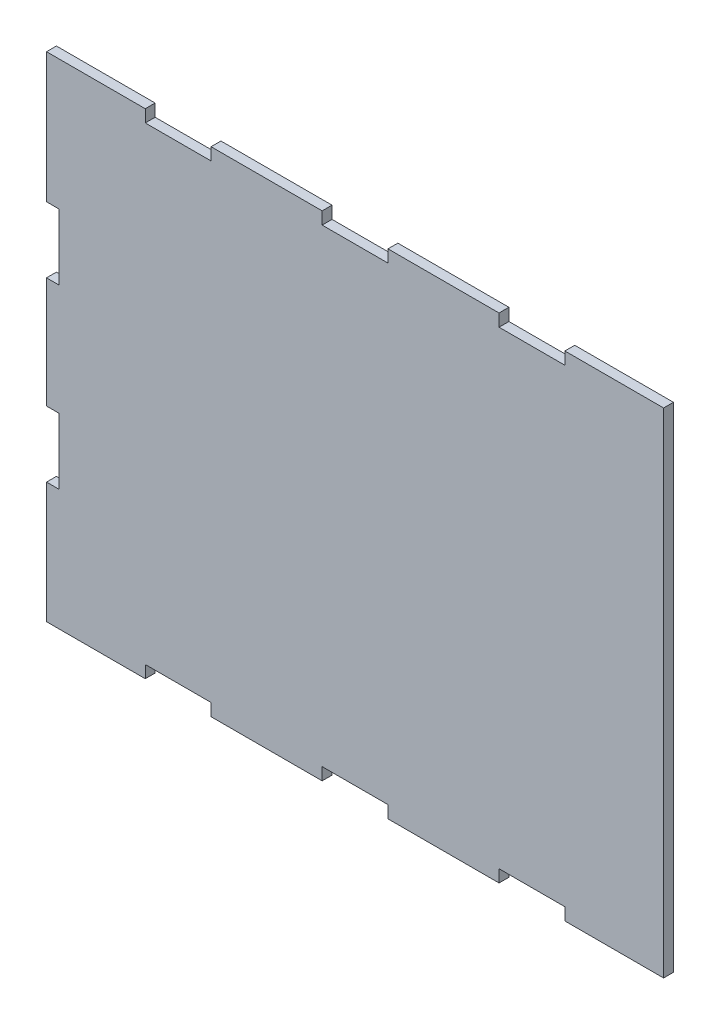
ISO-10303-21;
HEADER;
FILE_DESCRIPTION(('STEP AP214'),'2;1');
FILE_NAME('part.step','',(''),(''),'','','');
FILE_SCHEMA(('AUTOMOTIVE_DESIGN { 1 0 10303 214 1 1 1 1 }'));
ENDSEC;
DATA;
#1=APPLICATION_CONTEXT('core data for automotive mechanical design processes');
#2=APPLICATION_PROTOCOL_DEFINITION('international standard','automotive_design',2000,#1);
#3=PRODUCT_CONTEXT('',#1,'mechanical');
#4=PRODUCT('Part','Part','',(#3));
#5=PRODUCT_RELATED_PRODUCT_CATEGORY('part','',(#4));
#6=PRODUCT_DEFINITION_FORMATION('','',#4);
#7=PRODUCT_DEFINITION_CONTEXT('part definition',#1,'design');
#8=PRODUCT_DEFINITION('design','',#6,#7);
#9=PRODUCT_DEFINITION_SHAPE('','',#8);
#10=(LENGTH_UNIT() NAMED_UNIT(*) SI_UNIT(.MILLI.,.METRE.));
#11=(NAMED_UNIT(*) PLANE_ANGLE_UNIT() SI_UNIT($,.RADIAN.));
#12=(NAMED_UNIT(*) SI_UNIT($,.STERADIAN.) SOLID_ANGLE_UNIT());
#13=UNCERTAINTY_MEASURE_WITH_UNIT(LENGTH_MEASURE(1.E-05),#10,'distance_accuracy_value','');
#14=(GEOMETRIC_REPRESENTATION_CONTEXT(3) GLOBAL_UNCERTAINTY_ASSIGNED_CONTEXT((#13)) GLOBAL_UNIT_ASSIGNED_CONTEXT((#10,
#11,#12)) REPRESENTATION_CONTEXT('',''));
#15=CARTESIAN_POINT('',(0.,0.,0.));
#16=DIRECTION('',(0.,0.,1.));
#17=DIRECTION('',(1.,0.,0.));
#18=AXIS2_PLACEMENT_3D('',#15,#16,#17);
#19=CARTESIAN_POINT('',(-375.,142.,12.));
#20=DIRECTION('',(1.,0.,0.));
#21=DIRECTION('',(0.,0.,-1.));
#22=AXIS2_PLACEMENT_3D('',#19,#20,#21);
#23=PLANE('',#22);
#24=DIRECTION('',(0.,-1.,0.));
#25=VECTOR('',#24,1.);
#26=CARTESIAN_POINT('',(-375.,142.,0.));
#27=LINE('',#26,#25);
#28=CARTESIAN_POINT('',(-375.,300.,0.));
#29=VERTEX_POINT('',#28);
#30=CARTESIAN_POINT('',(-375.,142.,0.));
#31=VERTEX_POINT('',#30);
#32=EDGE_CURVE('E350',#29,#31,#27,.T.);
#33=ORIENTED_EDGE('',*,*,#32,.T.);
#34=DIRECTION('',(0.,0.,-1.));
#35=VECTOR('',#34,1.);
#36=CARTESIAN_POINT('',(-375.,142.,12.));
#37=LINE('',#36,#35);
#38=CARTESIAN_POINT('',(-375.,142.,12.));
#39=VERTEX_POINT('',#38);
#40=EDGE_CURVE('E12',#39,#31,#37,.T.);
#41=ORIENTED_EDGE('',*,*,#40,.F.);
#42=DIRECTION('',(0.,-1.,0.));
#43=VECTOR('',#42,1.);
#44=CARTESIAN_POINT('',(-375.,142.,12.));
#45=LINE('',#44,#43);
#46=CARTESIAN_POINT('',(-375.,300.,12.));
#47=VERTEX_POINT('',#46);
#48=EDGE_CURVE('E416',#47,#39,#45,.T.);
#49=ORIENTED_EDGE('',*,*,#48,.F.);
#50=DIRECTION('',(0.,0.,-1.));
#51=VECTOR('',#50,1.);
#52=CARTESIAN_POINT('',(-375.,300.,12.));
#53=LINE('',#52,#51);
#54=EDGE_CURVE('E343',#47,#29,#53,.T.);
#55=ORIENTED_EDGE('',*,*,#54,.T.);
#56=EDGE_LOOP('',(#33,#41,#49,#55));
#57=FACE_BOUND('',#56,.T.);
#58=ADVANCED_FACE('F82',(#57),#23,.F.);
#59=CARTESIAN_POINT('',(-375.,142.,12.));
#60=DIRECTION('',(0.,1.,0.));
#61=DIRECTION('',(0.,0.,1.));
#62=AXIS2_PLACEMENT_3D('',#59,#60,#61);
#63=PLANE('',#62);
#64=DIRECTION('',(1.,0.,0.));
#65=VECTOR('',#64,1.);
#66=CARTESIAN_POINT('',(-375.,142.,0.));
#67=LINE('',#66,#65);
#68=CARTESIAN_POINT('',(-360.,142.,0.));
#69=VERTEX_POINT('',#68);
#70=EDGE_CURVE('E355',#31,#69,#67,.T.);
#71=ORIENTED_EDGE('',*,*,#70,.T.);
#72=DIRECTION('',(0.,0.,-1.));
#73=VECTOR('',#72,1.);
#74=CARTESIAN_POINT('',(-360.,142.,12.));
#75=LINE('',#74,#73);
#76=CARTESIAN_POINT('',(-360.,142.,12.));
#77=VERTEX_POINT('',#76);
#78=EDGE_CURVE('E93',#77,#69,#75,.T.);
#79=ORIENTED_EDGE('',*,*,#78,.F.);
#80=DIRECTION('',(1.,0.,0.));
#81=VECTOR('',#80,1.);
#82=CARTESIAN_POINT('',(-375.,142.,12.));
#83=LINE('',#82,#81);
#84=EDGE_CURVE('E228',#39,#77,#83,.T.);
#85=ORIENTED_EDGE('',*,*,#84,.F.);
#86=ORIENTED_EDGE('',*,*,#40,.T.);
#87=EDGE_LOOP('',(#71,#79,#85,#86));
#88=FACE_BOUND('',#87,.T.);
#89=ADVANCED_FACE('F617',(#88),#63,.F.);
#90=CARTESIAN_POINT('',(-360.,142.,12.));
#91=DIRECTION('',(1.,0.,0.));
#92=DIRECTION('',(0.,0.,-1.));
#93=AXIS2_PLACEMENT_3D('',#90,#91,#92);
#94=PLANE('',#93);
#95=DIRECTION('',(0.,-1.,0.));
#96=VECTOR('',#95,1.);
#97=CARTESIAN_POINT('',(-360.,142.,0.));
#98=LINE('',#97,#96);
#99=CARTESIAN_POINT('',(-360.,62.0000000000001,0.));
#100=VERTEX_POINT('',#99);
#101=EDGE_CURVE('E354',#69,#100,#98,.T.);
#102=ORIENTED_EDGE('',*,*,#101,.T.);
#103=DIRECTION('',(0.,0.,-1.));
#104=VECTOR('',#103,1.);
#105=CARTESIAN_POINT('',(-360.,62.0000000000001,12.));
#106=LINE('',#105,#104);
#107=CARTESIAN_POINT('',(-360.,62.0000000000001,12.));
#108=VERTEX_POINT('',#107);
#109=EDGE_CURVE('E508',#108,#100,#106,.T.);
#110=ORIENTED_EDGE('',*,*,#109,.F.);
#111=DIRECTION('',(0.,-1.,0.));
#112=VECTOR('',#111,1.);
#113=CARTESIAN_POINT('',(-360.,142.,12.));
#114=LINE('',#113,#112);
#115=EDGE_CURVE('E516',#77,#108,#114,.T.);
#116=ORIENTED_EDGE('',*,*,#115,.F.);
#117=ORIENTED_EDGE('',*,*,#78,.T.);
#118=EDGE_LOOP('',(#102,#110,#116,#117));
#119=FACE_BOUND('',#118,.T.);
#120=ADVANCED_FACE('F517',(#119),#94,.F.);
#121=CARTESIAN_POINT('',(-375.,62.0000000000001,12.));
#122=DIRECTION('',(0.,-1.,0.));
#123=DIRECTION('',(1.,0.,0.));
#124=AXIS2_PLACEMENT_3D('',#121,#122,#123);
#125=PLANE('',#124);
#126=DIRECTION('',(-1.,0.,0.));
#127=VECTOR('',#126,1.);
#128=CARTESIAN_POINT('',(-375.,62.0000000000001,0.));
#129=LINE('',#128,#127);
#130=CARTESIAN_POINT('',(-375.,62.0000000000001,0.));
#131=VERTEX_POINT('',#130);
#132=EDGE_CURVE('E356',#100,#131,#129,.T.);
#133=ORIENTED_EDGE('',*,*,#132,.T.);
#134=DIRECTION('',(0.,0.,-1.));
#135=VECTOR('',#134,1.);
#136=CARTESIAN_POINT('',(-375.,62.0000000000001,12.));
#137=LINE('',#136,#135);
#138=CARTESIAN_POINT('',(-375.,62.0000000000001,12.));
#139=VERTEX_POINT('',#138);
#140=EDGE_CURVE('E510',#139,#131,#137,.T.);
#141=ORIENTED_EDGE('',*,*,#140,.F.);
#142=DIRECTION('',(-1.,0.,0.));
#143=VECTOR('',#142,1.);
#144=CARTESIAN_POINT('',(-375.,62.0000000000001,12.));
#145=LINE('',#144,#143);
#146=EDGE_CURVE('E536',#108,#139,#145,.T.);
#147=ORIENTED_EDGE('',*,*,#146,.F.);
#148=ORIENTED_EDGE('',*,*,#109,.T.);
#149=EDGE_LOOP('',(#133,#141,#147,#148));
#150=FACE_BOUND('',#149,.T.);
#151=ADVANCED_FACE('F527',(#150),#125,.F.);
#152=CARTESIAN_POINT('',(-375.,-72.9999999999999,12.));
#153=DIRECTION('',(1.,0.,0.));
#154=DIRECTION('',(0.,0.,-1.));
#155=AXIS2_PLACEMENT_3D('',#152,#153,#154);
#156=PLANE('',#155);
#157=DIRECTION('',(0.,-1.,0.));
#158=VECTOR('',#157,1.);
#159=CARTESIAN_POINT('',(-375.,-72.9999999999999,0.));
#160=LINE('',#159,#158);
#161=CARTESIAN_POINT('',(-375.,-72.9999999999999,0.));
#162=VERTEX_POINT('',#161);
#163=EDGE_CURVE('E358',#131,#162,#160,.T.);
#164=ORIENTED_EDGE('',*,*,#163,.T.);
#165=DIRECTION('',(0.,0.,-1.));
#166=VECTOR('',#165,1.);
#167=CARTESIAN_POINT('',(-375.,-72.9999999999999,12.));
#168=LINE('',#167,#166);
#169=CARTESIAN_POINT('',(-375.,-72.9999999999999,12.));
#170=VERTEX_POINT('',#169);
#171=EDGE_CURVE('E503',#170,#162,#168,.T.);
#172=ORIENTED_EDGE('',*,*,#171,.F.);
#173=DIRECTION('',(0.,-1.,0.));
#174=VECTOR('',#173,1.);
#175=CARTESIAN_POINT('',(-375.,-72.9999999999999,12.));
#176=LINE('',#175,#174);
#177=EDGE_CURVE('E531',#139,#170,#176,.T.);
#178=ORIENTED_EDGE('',*,*,#177,.F.);
#179=ORIENTED_EDGE('',*,*,#140,.T.);
#180=EDGE_LOOP('',(#164,#172,#178,#179));
#181=FACE_BOUND('',#180,.T.);
#182=ADVANCED_FACE('F533',(#181),#156,.F.);
#183=CARTESIAN_POINT('',(-375.,-72.9999999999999,12.));
#184=DIRECTION('',(0.,1.,0.));
#185=DIRECTION('',(-1.,0.,0.));
#186=AXIS2_PLACEMENT_3D('',#183,#184,#185);
#187=PLANE('',#186);
#188=DIRECTION('',(1.,0.,0.));
#189=VECTOR('',#188,1.);
#190=CARTESIAN_POINT('',(-375.,-72.9999999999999,0.));
#191=LINE('',#190,#189);
#192=CARTESIAN_POINT('',(-360.,-72.9999999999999,0.));
#193=VERTEX_POINT('',#192);
#194=EDGE_CURVE('E359',#162,#193,#191,.T.);
#195=ORIENTED_EDGE('',*,*,#194,.T.);
#196=DIRECTION('',(0.,0.,-1.));
#197=VECTOR('',#196,1.);
#198=CARTESIAN_POINT('',(-360.,-72.9999999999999,12.));
#199=LINE('',#198,#197);
#200=CARTESIAN_POINT('',(-360.,-72.9999999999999,12.));
#201=VERTEX_POINT('',#200);
#202=EDGE_CURVE('E501',#201,#193,#199,.T.);
#203=ORIENTED_EDGE('',*,*,#202,.F.);
#204=DIRECTION('',(1.,0.,0.));
#205=VECTOR('',#204,1.);
#206=CARTESIAN_POINT('',(-375.,-72.9999999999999,12.));
#207=LINE('',#206,#205);
#208=EDGE_CURVE('E532',#170,#201,#207,.T.);
#209=ORIENTED_EDGE('',*,*,#208,.F.);
#210=ORIENTED_EDGE('',*,*,#171,.T.);
#211=EDGE_LOOP('',(#195,#203,#209,#210));
#212=FACE_BOUND('',#211,.T.);
#213=ADVANCED_FACE('F629',(#212),#187,.F.);
#214=CARTESIAN_POINT('',(-360.,-72.9999999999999,12.));
#215=DIRECTION('',(1.,0.,0.));
#216=DIRECTION('',(0.,1.,0.));
#217=AXIS2_PLACEMENT_3D('',#214,#215,#216);
#218=PLANE('',#217);
#219=DIRECTION('',(0.,-1.,0.));
#220=VECTOR('',#219,1.);
#221=CARTESIAN_POINT('',(-360.,-72.9999999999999,0.));
#222=LINE('',#221,#220);
#223=CARTESIAN_POINT('',(-360.,-153.,0.));
#224=VERTEX_POINT('',#223);
#225=EDGE_CURVE('E365',#193,#224,#222,.T.);
#226=ORIENTED_EDGE('',*,*,#225,.T.);
#227=DIRECTION('',(0.,0.,-1.));
#228=VECTOR('',#227,1.);
#229=CARTESIAN_POINT('',(-360.,-153.,12.));
#230=LINE('',#229,#228);
#231=CARTESIAN_POINT('',(-360.,-153.,12.));
#232=VERTEX_POINT('',#231);
#233=EDGE_CURVE('E498',#232,#224,#230,.T.);
#234=ORIENTED_EDGE('',*,*,#233,.F.);
#235=DIRECTION('',(0.,-1.,0.));
#236=VECTOR('',#235,1.);
#237=CARTESIAN_POINT('',(-360.,-72.9999999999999,12.));
#238=LINE('',#237,#236);
#239=EDGE_CURVE('E538',#201,#232,#238,.T.);
#240=ORIENTED_EDGE('',*,*,#239,.F.);
#241=ORIENTED_EDGE('',*,*,#202,.T.);
#242=EDGE_LOOP('',(#226,#234,#240,#241));
#243=FACE_BOUND('',#242,.T.);
#244=ADVANCED_FACE('F633',(#243),#218,.F.);
#245=CARTESIAN_POINT('',(-375.,-153.,12.));
#246=DIRECTION('',(0.,-1.,0.));
#247=DIRECTION('',(0.,0.,-1.));
#248=AXIS2_PLACEMENT_3D('',#245,#246,#247);
#249=PLANE('',#248);
#250=DIRECTION('',(-1.,0.,0.));
#251=VECTOR('',#250,1.);
#252=CARTESIAN_POINT('',(-375.,-153.,0.));
#253=LINE('',#252,#251);
#254=CARTESIAN_POINT('',(-375.,-153.,0.));
#255=VERTEX_POINT('',#254);
#256=EDGE_CURVE('E362',#224,#255,#253,.T.);
#257=ORIENTED_EDGE('',*,*,#256,.T.);
#258=DIRECTION('',(0.,0.,-1.));
#259=VECTOR('',#258,1.);
#260=CARTESIAN_POINT('',(-375.,-153.,12.));
#261=LINE('',#260,#259);
#262=CARTESIAN_POINT('',(-375.,-153.,12.));
#263=VERTEX_POINT('',#262);
#264=EDGE_CURVE('E494',#263,#255,#261,.T.);
#265=ORIENTED_EDGE('',*,*,#264,.F.);
#266=DIRECTION('',(-1.,0.,0.));
#267=VECTOR('',#266,1.);
#268=CARTESIAN_POINT('',(-375.,-153.,12.));
#269=LINE('',#268,#267);
#270=EDGE_CURVE('E542',#232,#263,#269,.T.);
#271=ORIENTED_EDGE('',*,*,#270,.F.);
#272=ORIENTED_EDGE('',*,*,#233,.T.);
#273=EDGE_LOOP('',(#257,#265,#271,#272));
#274=FACE_BOUND('',#273,.T.);
#275=ADVANCED_FACE('F640',(#274),#249,.F.);
#276=CARTESIAN_POINT('',(-375.,-300.,12.));
#277=DIRECTION('',(1.,0.,0.));
#278=DIRECTION('',(0.,0.,-1.));
#279=AXIS2_PLACEMENT_3D('',#276,#277,#278);
#280=PLANE('',#279);
#281=DIRECTION('',(0.,-1.,0.));
#282=VECTOR('',#281,1.);
#283=CARTESIAN_POINT('',(-375.,-300.,0.));
#284=LINE('',#283,#282);
#285=CARTESIAN_POINT('',(-375.,-300.,0.));
#286=VERTEX_POINT('',#285);
#287=EDGE_CURVE('E366',#255,#286,#284,.T.);
#288=ORIENTED_EDGE('',*,*,#287,.T.);
#289=DIRECTION('',(0.,0.,-1.));
#290=VECTOR('',#289,1.);
#291=CARTESIAN_POINT('',(-375.,-300.,12.));
#292=LINE('',#291,#290);
#293=CARTESIAN_POINT('',(-375.,-300.,12.));
#294=VERTEX_POINT('',#293);
#295=EDGE_CURVE('E495',#294,#286,#292,.T.);
#296=ORIENTED_EDGE('',*,*,#295,.F.);
#297=DIRECTION('',(0.,-1.,0.));
#298=VECTOR('',#297,1.);
#299=CARTESIAN_POINT('',(-375.,-300.,12.));
#300=LINE('',#299,#298);
#301=EDGE_CURVE('E546',#263,#294,#300,.T.);
#302=ORIENTED_EDGE('',*,*,#301,.F.);
#303=ORIENTED_EDGE('',*,*,#264,.T.);
#304=EDGE_LOOP('',(#288,#296,#302,#303));
#305=FACE_BOUND('',#304,.T.);
#306=ADVANCED_FACE('F642',(#305),#280,.F.);
#307=CARTESIAN_POINT('',(-255.,-300.,12.));
#308=DIRECTION('',(0.,1.,0.));
#309=DIRECTION('',(-1.,0.,0.));
#310=AXIS2_PLACEMENT_3D('',#307,#308,#309);
#311=PLANE('',#310);
#312=DIRECTION('',(1.,0.,0.));
#313=VECTOR('',#312,1.);
#314=CARTESIAN_POINT('',(-255.,-300.,0.));
#315=LINE('',#314,#313);
#316=CARTESIAN_POINT('',(-255.,-300.,0.));
#317=VERTEX_POINT('',#316);
#318=EDGE_CURVE('E367',#286,#317,#315,.T.);
#319=ORIENTED_EDGE('',*,*,#318,.T.);
#320=DIRECTION('',(0.,0.,-1.));
#321=VECTOR('',#320,1.);
#322=CARTESIAN_POINT('',(-255.,-300.,12.));
#323=LINE('',#322,#321);
#324=CARTESIAN_POINT('',(-255.,-300.,12.));
#325=VERTEX_POINT('',#324);
#326=EDGE_CURVE('E489',#325,#317,#323,.T.);
#327=ORIENTED_EDGE('',*,*,#326,.F.);
#328=DIRECTION('',(1.,0.,0.));
#329=VECTOR('',#328,1.);
#330=CARTESIAN_POINT('',(-255.,-300.,12.));
#331=LINE('',#330,#329);
#332=EDGE_CURVE('E547',#294,#325,#331,.T.);
#333=ORIENTED_EDGE('',*,*,#332,.F.);
#334=ORIENTED_EDGE('',*,*,#295,.T.);
#335=EDGE_LOOP('',(#319,#327,#333,#334));
#336=FACE_BOUND('',#335,.T.);
#337=ADVANCED_FACE('F643',(#336),#311,.F.);
#338=CARTESIAN_POINT('',(-255.,-300.,12.));
#339=DIRECTION('',(-1.,0.,0.));
#340=DIRECTION('',(0.,0.,1.));
#341=AXIS2_PLACEMENT_3D('',#338,#339,#340);
#342=PLANE('',#341);
#343=DIRECTION('',(0.,1.,0.));
#344=VECTOR('',#343,1.);
#345=CARTESIAN_POINT('',(-255.,-300.,0.));
#346=LINE('',#345,#344);
#347=CARTESIAN_POINT('',(-255.,-285.,0.));
#348=VERTEX_POINT('',#347);
#349=EDGE_CURVE('E369',#317,#348,#346,.T.);
#350=ORIENTED_EDGE('',*,*,#349,.T.);
#351=DIRECTION('',(0.,0.,-1.));
#352=VECTOR('',#351,1.);
#353=CARTESIAN_POINT('',(-255.,-285.,12.));
#354=LINE('',#353,#352);
#355=CARTESIAN_POINT('',(-255.,-285.,12.));
#356=VERTEX_POINT('',#355);
#357=EDGE_CURVE('E488',#356,#348,#354,.T.);
#358=ORIENTED_EDGE('',*,*,#357,.F.);
#359=DIRECTION('',(0.,1.,0.));
#360=VECTOR('',#359,1.);
#361=CARTESIAN_POINT('',(-255.,-300.,12.));
#362=LINE('',#361,#360);
#363=EDGE_CURVE('E549',#325,#356,#362,.T.);
#364=ORIENTED_EDGE('',*,*,#363,.F.);
#365=ORIENTED_EDGE('',*,*,#326,.T.);
#366=EDGE_LOOP('',(#350,#358,#364,#365));
#367=FACE_BOUND('',#366,.T.);
#368=ADVANCED_FACE('F646',(#367),#342,.F.);
#369=CARTESIAN_POINT('',(-255.,-285.,12.));
#370=DIRECTION('',(0.,1.,0.));
#371=DIRECTION('',(0.,0.,1.));
#372=AXIS2_PLACEMENT_3D('',#369,#370,#371);
#373=PLANE('',#372);
#374=DIRECTION('',(1.,0.,0.));
#375=VECTOR('',#374,1.);
#376=CARTESIAN_POINT('',(-255.,-285.,0.));
#377=LINE('',#376,#375);
#378=CARTESIAN_POINT('',(-175.,-285.,0.));
#379=VERTEX_POINT('',#378);
#380=EDGE_CURVE('E375',#348,#379,#377,.T.);
#381=ORIENTED_EDGE('',*,*,#380,.T.);
#382=DIRECTION('',(0.,0.,-1.));
#383=VECTOR('',#382,1.);
#384=CARTESIAN_POINT('',(-175.,-285.,12.));
#385=LINE('',#384,#383);
#386=CARTESIAN_POINT('',(-175.,-285.,12.));
#387=VERTEX_POINT('',#386);
#388=EDGE_CURVE('E481',#387,#379,#385,.T.);
#389=ORIENTED_EDGE('',*,*,#388,.F.);
#390=DIRECTION('',(1.,0.,0.));
#391=VECTOR('',#390,1.);
#392=CARTESIAN_POINT('',(-255.,-285.,12.));
#393=LINE('',#392,#391);
#394=EDGE_CURVE('E555',#356,#387,#393,.T.);
#395=ORIENTED_EDGE('',*,*,#394,.F.);
#396=ORIENTED_EDGE('',*,*,#357,.T.);
#397=EDGE_LOOP('',(#381,#389,#395,#396));
#398=FACE_BOUND('',#397,.T.);
#399=ADVANCED_FACE('F651',(#398),#373,.F.);
#400=CARTESIAN_POINT('',(-175.,-300.,12.));
#401=DIRECTION('',(1.,0.,0.));
#402=DIRECTION('',(0.,0.,-1.));
#403=AXIS2_PLACEMENT_3D('',#400,#401,#402);
#404=PLANE('',#403);
#405=DIRECTION('',(0.,-1.,0.));
#406=VECTOR('',#405,1.);
#407=CARTESIAN_POINT('',(-175.,-300.,0.));
#408=LINE('',#407,#406);
#409=CARTESIAN_POINT('',(-175.,-300.,0.));
#410=VERTEX_POINT('',#409);
#411=EDGE_CURVE('E371',#379,#410,#408,.T.);
#412=ORIENTED_EDGE('',*,*,#411,.T.);
#413=DIRECTION('',(0.,0.,-1.));
#414=VECTOR('',#413,1.);
#415=CARTESIAN_POINT('',(-175.,-300.,12.));
#416=LINE('',#415,#414);
#417=CARTESIAN_POINT('',(-175.,-300.,12.));
#418=VERTEX_POINT('',#417);
#419=EDGE_CURVE('E478',#418,#410,#416,.T.);
#420=ORIENTED_EDGE('',*,*,#419,.F.);
#421=DIRECTION('',(0.,-1.,0.));
#422=VECTOR('',#421,1.);
#423=CARTESIAN_POINT('',(-175.,-300.,12.));
#424=LINE('',#423,#422);
#425=EDGE_CURVE('E551',#387,#418,#424,.T.);
#426=ORIENTED_EDGE('',*,*,#425,.F.);
#427=ORIENTED_EDGE('',*,*,#388,.T.);
#428=EDGE_LOOP('',(#412,#420,#426,#427));
#429=FACE_BOUND('',#428,.T.);
#430=ADVANCED_FACE('F659',(#429),#404,.F.);
#431=CARTESIAN_POINT('',(-39.9999999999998,-300.,12.));
#432=DIRECTION('',(0.,1.,0.));
#433=DIRECTION('',(-1.,0.,0.));
#434=AXIS2_PLACEMENT_3D('',#431,#432,#433);
#435=PLANE('',#434);
#436=DIRECTION('',(1.,0.,0.));
#437=VECTOR('',#436,1.);
#438=CARTESIAN_POINT('',(-39.9999999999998,-300.,0.));
#439=LINE('',#438,#437);
#440=CARTESIAN_POINT('',(-39.9999999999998,-300.,0.));
#441=VERTEX_POINT('',#440);
#442=EDGE_CURVE('E377',#410,#441,#439,.T.);
#443=ORIENTED_EDGE('',*,*,#442,.T.);
#444=DIRECTION('',(0.,0.,-1.));
#445=VECTOR('',#444,1.);
#446=CARTESIAN_POINT('',(-39.9999999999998,-300.,12.));
#447=LINE('',#446,#445);
#448=CARTESIAN_POINT('',(-39.9999999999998,-300.,12.));
#449=VERTEX_POINT('',#448);
#450=EDGE_CURVE('E479',#449,#441,#447,.T.);
#451=ORIENTED_EDGE('',*,*,#450,.F.);
#452=DIRECTION('',(1.,0.,0.));
#453=VECTOR('',#452,1.);
#454=CARTESIAN_POINT('',(-39.9999999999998,-300.,12.));
#455=LINE('',#454,#453);
#456=EDGE_CURVE('E557',#418,#449,#455,.T.);
#457=ORIENTED_EDGE('',*,*,#456,.F.);
#458=ORIENTED_EDGE('',*,*,#419,.T.);
#459=EDGE_LOOP('',(#443,#451,#457,#458));
#460=FACE_BOUND('',#459,.T.);
#461=ADVANCED_FACE('F663',(#460),#435,.F.);
#462=CARTESIAN_POINT('',(-39.9999999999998,-300.,12.));
#463=DIRECTION('',(-1.,0.,0.));
#464=DIRECTION('',(0.,0.,1.));
#465=AXIS2_PLACEMENT_3D('',#462,#463,#464);
#466=PLANE('',#465);
#467=DIRECTION('',(0.,1.,0.));
#468=VECTOR('',#467,1.);
#469=CARTESIAN_POINT('',(-39.9999999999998,-300.,0.));
#470=LINE('',#469,#468);
#471=CARTESIAN_POINT('',(-39.9999999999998,-285.,0.));
#472=VERTEX_POINT('',#471);
#473=EDGE_CURVE('E380',#441,#472,#470,.T.);
#474=ORIENTED_EDGE('',*,*,#473,.T.);
#475=DIRECTION('',(0.,0.,-1.));
#476=VECTOR('',#475,1.);
#477=CARTESIAN_POINT('',(-39.9999999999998,-285.,12.));
#478=LINE('',#477,#476);
#479=CARTESIAN_POINT('',(-39.9999999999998,-285.,12.));
#480=VERTEX_POINT('',#479);
#481=EDGE_CURVE('E474',#480,#472,#478,.T.);
#482=ORIENTED_EDGE('',*,*,#481,.F.);
#483=DIRECTION('',(0.,1.,0.));
#484=VECTOR('',#483,1.);
#485=CARTESIAN_POINT('',(-39.9999999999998,-300.,12.));
#486=LINE('',#485,#484);
#487=EDGE_CURVE('E560',#449,#480,#486,.T.);
#488=ORIENTED_EDGE('',*,*,#487,.F.);
#489=ORIENTED_EDGE('',*,*,#450,.T.);
#490=EDGE_LOOP('',(#474,#482,#488,#489));
#491=FACE_BOUND('',#490,.T.);
#492=ADVANCED_FACE('F664',(#491),#466,.F.);
#493=CARTESIAN_POINT('',(-39.9999999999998,-285.,12.));
#494=DIRECTION('',(0.,1.,0.));
#495=DIRECTION('',(0.,0.,1.));
#496=AXIS2_PLACEMENT_3D('',#493,#494,#495);
#497=PLANE('',#496);
#498=DIRECTION('',(1.,0.,0.));
#499=VECTOR('',#498,1.);
#500=CARTESIAN_POINT('',(-39.9999999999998,-285.,0.));
#501=LINE('',#500,#499);
#502=CARTESIAN_POINT('',(40.0000000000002,-285.,0.));
#503=VERTEX_POINT('',#502);
#504=EDGE_CURVE('E378',#472,#503,#501,.T.);
#505=ORIENTED_EDGE('',*,*,#504,.T.);
#506=DIRECTION('',(0.,0.,-1.));
#507=VECTOR('',#506,1.);
#508=CARTESIAN_POINT('',(40.0000000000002,-285.,12.));
#509=LINE('',#508,#507);
#510=CARTESIAN_POINT('',(40.0000000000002,-285.,12.));
#511=VERTEX_POINT('',#510);
#512=EDGE_CURVE('E472',#511,#503,#509,.T.);
#513=ORIENTED_EDGE('',*,*,#512,.F.);
#514=DIRECTION('',(1.,0.,0.));
#515=VECTOR('',#514,1.);
#516=CARTESIAN_POINT('',(-39.9999999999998,-285.,12.));
#517=LINE('',#516,#515);
#518=EDGE_CURVE('E558',#480,#511,#517,.T.);
#519=ORIENTED_EDGE('',*,*,#518,.F.);
#520=ORIENTED_EDGE('',*,*,#481,.T.);
#521=EDGE_LOOP('',(#505,#513,#519,#520));
#522=FACE_BOUND('',#521,.T.);
#523=ADVANCED_FACE('F669',(#522),#497,.F.);
#524=CARTESIAN_POINT('',(40.0000000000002,-300.,12.));
#525=DIRECTION('',(1.,0.,0.));
#526=DIRECTION('',(0.,0.,-1.));
#527=AXIS2_PLACEMENT_3D('',#524,#525,#526);
#528=PLANE('',#527);
#529=DIRECTION('',(0.,-1.,0.));
#530=VECTOR('',#529,1.);
#531=CARTESIAN_POINT('',(40.0000000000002,-300.,0.));
#532=LINE('',#531,#530);
#533=CARTESIAN_POINT('',(40.0000000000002,-300.,0.));
#534=VERTEX_POINT('',#533);
#535=EDGE_CURVE('E385',#503,#534,#532,.T.);
#536=ORIENTED_EDGE('',*,*,#535,.T.);
#537=DIRECTION('',(0.,0.,-1.));
#538=VECTOR('',#537,1.);
#539=CARTESIAN_POINT('',(40.0000000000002,-300.,12.));
#540=LINE('',#539,#538);
#541=CARTESIAN_POINT('',(40.0000000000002,-300.,12.));
#542=VERTEX_POINT('',#541);
#543=EDGE_CURVE('E470',#542,#534,#540,.T.);
#544=ORIENTED_EDGE('',*,*,#543,.F.);
#545=DIRECTION('',(0.,-1.,0.));
#546=VECTOR('',#545,1.);
#547=CARTESIAN_POINT('',(40.0000000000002,-300.,12.));
#548=LINE('',#547,#546);
#549=EDGE_CURVE('E565',#511,#542,#548,.T.);
#550=ORIENTED_EDGE('',*,*,#549,.F.);
#551=ORIENTED_EDGE('',*,*,#512,.T.);
#552=EDGE_LOOP('',(#536,#544,#550,#551));
#553=FACE_BOUND('',#552,.T.);
#554=ADVANCED_FACE('F673',(#553),#528,.F.);
#555=CARTESIAN_POINT('',(175.,-300.,12.));
#556=DIRECTION('',(0.,1.,0.));
#557=DIRECTION('',(-1.,0.,0.));
#558=AXIS2_PLACEMENT_3D('',#555,#556,#557);
#559=PLANE('',#558);
#560=DIRECTION('',(1.,0.,0.));
#561=VECTOR('',#560,1.);
#562=CARTESIAN_POINT('',(175.,-300.,0.));
#563=LINE('',#562,#561);
#564=CARTESIAN_POINT('',(175.,-300.,0.));
#565=VERTEX_POINT('',#564);
#566=EDGE_CURVE('E384',#534,#565,#563,.T.);
#567=ORIENTED_EDGE('',*,*,#566,.T.);
#568=DIRECTION('',(0.,0.,-1.));
#569=VECTOR('',#568,1.);
#570=CARTESIAN_POINT('',(175.,-300.,12.));
#571=LINE('',#570,#569);
#572=CARTESIAN_POINT('',(175.,-300.,12.));
#573=VERTEX_POINT('',#572);
#574=EDGE_CURVE('E463',#573,#565,#571,.T.);
#575=ORIENTED_EDGE('',*,*,#574,.F.);
#576=DIRECTION('',(1.,0.,0.));
#577=VECTOR('',#576,1.);
#578=CARTESIAN_POINT('',(175.,-300.,12.));
#579=LINE('',#578,#577);
#580=EDGE_CURVE('E564',#542,#573,#579,.T.);
#581=ORIENTED_EDGE('',*,*,#580,.F.);
#582=ORIENTED_EDGE('',*,*,#543,.T.);
#583=EDGE_LOOP('',(#567,#575,#581,#582));
#584=FACE_BOUND('',#583,.T.);
#585=ADVANCED_FACE('F680',(#584),#559,.F.);
#586=CARTESIAN_POINT('',(175.,-300.,12.));
#587=DIRECTION('',(-1.,0.,0.));
#588=DIRECTION('',(0.,0.,1.));
#589=AXIS2_PLACEMENT_3D('',#586,#587,#588);
#590=PLANE('',#589);
#591=DIRECTION('',(0.,1.,0.));
#592=VECTOR('',#591,1.);
#593=CARTESIAN_POINT('',(175.,-300.,0.));
#594=LINE('',#593,#592);
#595=CARTESIAN_POINT('',(175.,-285.,0.));
#596=VERTEX_POINT('',#595);
#597=EDGE_CURVE('E387',#565,#596,#594,.T.);
#598=ORIENTED_EDGE('',*,*,#597,.T.);
#599=DIRECTION('',(0.,0.,-1.));
#600=VECTOR('',#599,1.);
#601=CARTESIAN_POINT('',(175.,-285.,12.));
#602=LINE('',#601,#600);
#603=CARTESIAN_POINT('',(175.,-285.,12.));
#604=VERTEX_POINT('',#603);
#605=EDGE_CURVE('E465',#604,#596,#602,.T.);
#606=ORIENTED_EDGE('',*,*,#605,.F.);
#607=DIRECTION('',(0.,1.,0.));
#608=VECTOR('',#607,1.);
#609=CARTESIAN_POINT('',(175.,-300.,12.));
#610=LINE('',#609,#608);
#611=EDGE_CURVE('E567',#573,#604,#610,.T.);
#612=ORIENTED_EDGE('',*,*,#611,.F.);
#613=ORIENTED_EDGE('',*,*,#574,.T.);
#614=EDGE_LOOP('',(#598,#606,#612,#613));
#615=FACE_BOUND('',#614,.T.);
#616=ADVANCED_FACE('F681',(#615),#590,.F.);
#617=CARTESIAN_POINT('',(175.,-285.,12.));
#618=DIRECTION('',(0.,1.,0.));
#619=DIRECTION('',(0.,0.,1.));
#620=AXIS2_PLACEMENT_3D('',#617,#618,#619);
#621=PLANE('',#620);
#622=DIRECTION('',(1.,0.,0.));
#623=VECTOR('',#622,1.);
#624=CARTESIAN_POINT('',(175.,-285.,0.));
#625=LINE('',#624,#623);
#626=CARTESIAN_POINT('',(255.,-285.,0.));
#627=VERTEX_POINT('',#626);
#628=EDGE_CURVE('E390',#596,#627,#625,.T.);
#629=ORIENTED_EDGE('',*,*,#628,.T.);
#630=DIRECTION('',(0.,0.,-1.));
#631=VECTOR('',#630,1.);
#632=CARTESIAN_POINT('',(255.,-285.,12.));
#633=LINE('',#632,#631);
#634=CARTESIAN_POINT('',(255.,-285.,12.));
#635=VERTEX_POINT('',#634);
#636=EDGE_CURVE('E458',#635,#627,#633,.T.);
#637=ORIENTED_EDGE('',*,*,#636,.F.);
#638=DIRECTION('',(1.,0.,0.));
#639=VECTOR('',#638,1.);
#640=CARTESIAN_POINT('',(175.,-285.,12.));
#641=LINE('',#640,#639);
#642=EDGE_CURVE('E570',#604,#635,#641,.T.);
#643=ORIENTED_EDGE('',*,*,#642,.F.);
#644=ORIENTED_EDGE('',*,*,#605,.T.);
#645=EDGE_LOOP('',(#629,#637,#643,#644));
#646=FACE_BOUND('',#645,.T.);
#647=ADVANCED_FACE('F684',(#646),#621,.F.);
#648=CARTESIAN_POINT('',(255.,-300.,12.));
#649=DIRECTION('',(1.,0.,0.));
#650=DIRECTION('',(0.,0.,-1.));
#651=AXIS2_PLACEMENT_3D('',#648,#649,#650);
#652=PLANE('',#651);
#653=DIRECTION('',(0.,-1.,0.));
#654=VECTOR('',#653,1.);
#655=CARTESIAN_POINT('',(255.,-300.,0.));
#656=LINE('',#655,#654);
#657=CARTESIAN_POINT('',(255.,-300.,0.));
#658=VERTEX_POINT('',#657);
#659=EDGE_CURVE('E388',#627,#658,#656,.T.);
#660=ORIENTED_EDGE('',*,*,#659,.T.);
#661=DIRECTION('',(0.,0.,-1.));
#662=VECTOR('',#661,1.);
#663=CARTESIAN_POINT('',(255.,-300.,12.));
#664=LINE('',#663,#662);
#665=CARTESIAN_POINT('',(255.,-300.,12.));
#666=VERTEX_POINT('',#665);
#667=EDGE_CURVE('E456',#666,#658,#664,.T.);
#668=ORIENTED_EDGE('',*,*,#667,.F.);
#669=DIRECTION('',(0.,-1.,0.));
#670=VECTOR('',#669,1.);
#671=CARTESIAN_POINT('',(255.,-300.,12.));
#672=LINE('',#671,#670);
#673=EDGE_CURVE('E568',#635,#666,#672,.T.);
#674=ORIENTED_EDGE('',*,*,#673,.F.);
#675=ORIENTED_EDGE('',*,*,#636,.T.);
#676=EDGE_LOOP('',(#660,#668,#674,#675));
#677=FACE_BOUND('',#676,.T.);
#678=ADVANCED_FACE('F686',(#677),#652,.F.);
#679=CARTESIAN_POINT('',(375.,-300.,12.));
#680=DIRECTION('',(0.,1.,0.));
#681=DIRECTION('',(-1.,0.,0.));
#682=AXIS2_PLACEMENT_3D('',#679,#680,#681);
#683=PLANE('',#682);
#684=DIRECTION('',(1.,0.,0.));
#685=VECTOR('',#684,1.);
#686=CARTESIAN_POINT('',(375.,-300.,0.));
#687=LINE('',#686,#685);
#688=CARTESIAN_POINT('',(375.,-300.,0.));
#689=VERTEX_POINT('',#688);
#690=EDGE_CURVE('E392',#658,#689,#687,.T.);
#691=ORIENTED_EDGE('',*,*,#690,.T.);
#692=DIRECTION('',(0.,0.,-1.));
#693=VECTOR('',#692,1.);
#694=CARTESIAN_POINT('',(375.,-300.,12.));
#695=LINE('',#694,#693);
#696=CARTESIAN_POINT('',(375.,-300.,12.));
#697=VERTEX_POINT('',#696);
#698=EDGE_CURVE('E453',#697,#689,#695,.T.);
#699=ORIENTED_EDGE('',*,*,#698,.F.);
#700=DIRECTION('',(1.,0.,0.));
#701=VECTOR('',#700,1.);
#702=CARTESIAN_POINT('',(375.,-300.,12.));
#703=LINE('',#702,#701);
#704=EDGE_CURVE('E572',#666,#697,#703,.T.);
#705=ORIENTED_EDGE('',*,*,#704,.F.);
#706=ORIENTED_EDGE('',*,*,#667,.T.);
#707=EDGE_LOOP('',(#691,#699,#705,#706));
#708=FACE_BOUND('',#707,.T.);
#709=ADVANCED_FACE('F695',(#708),#683,.F.);
#710=CARTESIAN_POINT('',(375.,-300.,12.));
#711=DIRECTION('',(-1.,0.,0.));
#712=DIRECTION('',(0.,0.,1.));
#713=AXIS2_PLACEMENT_3D('',#710,#711,#712);
#714=PLANE('',#713);
#715=DIRECTION('',(0.,1.,0.));
#716=VECTOR('',#715,1.);
#717=CARTESIAN_POINT('',(375.,-300.,0.));
#718=LINE('',#717,#716);
#719=CARTESIAN_POINT('',(375.,300.,0.));
#720=VERTEX_POINT('',#719);
#721=EDGE_CURVE('E395',#689,#720,#718,.T.);
#722=ORIENTED_EDGE('',*,*,#721,.T.);
#723=DIRECTION('',(0.,0.,-1.));
#724=VECTOR('',#723,1.);
#725=CARTESIAN_POINT('',(375.,300.,12.));
#726=LINE('',#725,#724);
#727=CARTESIAN_POINT('',(375.,300.,12.));
#728=VERTEX_POINT('',#727);
#729=EDGE_CURVE('E449',#728,#720,#726,.T.);
#730=ORIENTED_EDGE('',*,*,#729,.F.);
#731=DIRECTION('',(0.,1.,0.));
#732=VECTOR('',#731,1.);
#733=CARTESIAN_POINT('',(375.,-300.,12.));
#734=LINE('',#733,#732);
#735=EDGE_CURVE('E575',#697,#728,#734,.T.);
#736=ORIENTED_EDGE('',*,*,#735,.F.);
#737=ORIENTED_EDGE('',*,*,#698,.T.);
#738=EDGE_LOOP('',(#722,#730,#736,#737));
#739=FACE_BOUND('',#738,.T.);
#740=ADVANCED_FACE('F700',(#739),#714,.F.);
#741=CARTESIAN_POINT('',(375.,300.,12.));
#742=DIRECTION('',(0.,-1.,0.));
#743=DIRECTION('',(1.,0.,0.));
#744=AXIS2_PLACEMENT_3D('',#741,#742,#743);
#745=PLANE('',#744);
#746=DIRECTION('',(-1.,0.,0.));
#747=VECTOR('',#746,1.);
#748=CARTESIAN_POINT('',(375.,300.,0.));
#749=LINE('',#748,#747);
#750=CARTESIAN_POINT('',(255.,300.,0.));
#751=VERTEX_POINT('',#750);
#752=EDGE_CURVE('E398',#720,#751,#749,.T.);
#753=ORIENTED_EDGE('',*,*,#752,.T.);
#754=DIRECTION('',(0.,0.,-1.));
#755=VECTOR('',#754,1.);
#756=CARTESIAN_POINT('',(255.,300.,12.));
#757=LINE('',#756,#755);
#758=CARTESIAN_POINT('',(255.,300.,12.));
#759=VERTEX_POINT('',#758);
#760=EDGE_CURVE('E450',#759,#751,#757,.T.);
#761=ORIENTED_EDGE('',*,*,#760,.F.);
#762=DIRECTION('',(-1.,0.,0.));
#763=VECTOR('',#762,1.);
#764=CARTESIAN_POINT('',(375.,300.,12.));
#765=LINE('',#764,#763);
#766=EDGE_CURVE('E578',#728,#759,#765,.T.);
#767=ORIENTED_EDGE('',*,*,#766,.F.);
#768=ORIENTED_EDGE('',*,*,#729,.T.);
#769=EDGE_LOOP('',(#753,#761,#767,#768));
#770=FACE_BOUND('',#769,.T.);
#771=ADVANCED_FACE('F702',(#770),#745,.F.);
#772=CARTESIAN_POINT('',(255.,300.,12.));
#773=DIRECTION('',(1.,0.,0.));
#774=DIRECTION('',(0.,0.,-1.));
#775=AXIS2_PLACEMENT_3D('',#772,#773,#774);
#776=PLANE('',#775);
#777=DIRECTION('',(0.,-1.,0.));
#778=VECTOR('',#777,1.);
#779=CARTESIAN_POINT('',(255.,300.,0.));
#780=LINE('',#779,#778);
#781=CARTESIAN_POINT('',(255.,285.,0.));
#782=VERTEX_POINT('',#781);
#783=EDGE_CURVE('E396',#751,#782,#780,.T.);
#784=ORIENTED_EDGE('',*,*,#783,.T.);
#785=DIRECTION('',(0.,0.,-1.));
#786=VECTOR('',#785,1.);
#787=CARTESIAN_POINT('',(255.,285.,12.));
#788=LINE('',#787,#786);
#789=CARTESIAN_POINT('',(255.,285.,12.));
#790=VERTEX_POINT('',#789);
#791=EDGE_CURVE('E444',#790,#782,#788,.T.);
#792=ORIENTED_EDGE('',*,*,#791,.F.);
#793=DIRECTION('',(0.,-1.,0.));
#794=VECTOR('',#793,1.);
#795=CARTESIAN_POINT('',(255.,300.,12.));
#796=LINE('',#795,#794);
#797=EDGE_CURVE('E576',#759,#790,#796,.T.);
#798=ORIENTED_EDGE('',*,*,#797,.F.);
#799=ORIENTED_EDGE('',*,*,#760,.T.);
#800=EDGE_LOOP('',(#784,#792,#798,#799));
#801=FACE_BOUND('',#800,.T.);
#802=ADVANCED_FACE('F703',(#801),#776,.F.);
#803=CARTESIAN_POINT('',(175.,285.,12.));
#804=DIRECTION('',(0.,-1.,0.));
#805=DIRECTION('',(0.,0.,-1.));
#806=AXIS2_PLACEMENT_3D('',#803,#804,#805);
#807=PLANE('',#806);
#808=DIRECTION('',(-1.,0.,0.));
#809=VECTOR('',#808,1.);
#810=CARTESIAN_POINT('',(175.,285.,0.));
#811=LINE('',#810,#809);
#812=CARTESIAN_POINT('',(175.,285.,0.));
#813=VERTEX_POINT('',#812);
#814=EDGE_CURVE('E397',#782,#813,#811,.T.);
#815=ORIENTED_EDGE('',*,*,#814,.T.);
#816=DIRECTION('',(0.,0.,-1.));
#817=VECTOR('',#816,1.);
#818=CARTESIAN_POINT('',(175.,285.,12.));
#819=LINE('',#818,#817);
#820=CARTESIAN_POINT('',(175.,285.,12.));
#821=VERTEX_POINT('',#820);
#822=EDGE_CURVE('E443',#821,#813,#819,.T.);
#823=ORIENTED_EDGE('',*,*,#822,.F.);
#824=DIRECTION('',(-1.,0.,0.));
#825=VECTOR('',#824,1.);
#826=CARTESIAN_POINT('',(175.,285.,12.));
#827=LINE('',#826,#825);
#828=EDGE_CURVE('E577',#790,#821,#827,.T.);
#829=ORIENTED_EDGE('',*,*,#828,.F.);
#830=ORIENTED_EDGE('',*,*,#791,.T.);
#831=EDGE_LOOP('',(#815,#823,#829,#830));
#832=FACE_BOUND('',#831,.T.);
#833=ADVANCED_FACE('F710',(#832),#807,.F.);
#834=CARTESIAN_POINT('',(175.,300.,12.));
#835=DIRECTION('',(-1.,0.,0.));
#836=DIRECTION('',(0.,0.,1.));
#837=AXIS2_PLACEMENT_3D('',#834,#835,#836);
#838=PLANE('',#837);
#839=DIRECTION('',(0.,1.,0.));
#840=VECTOR('',#839,1.);
#841=CARTESIAN_POINT('',(175.,300.,0.));
#842=LINE('',#841,#840);
#843=CARTESIAN_POINT('',(175.,300.,0.));
#844=VERTEX_POINT('',#843);
#845=EDGE_CURVE('E405',#813,#844,#842,.T.);
#846=ORIENTED_EDGE('',*,*,#845,.T.);
#847=DIRECTION('',(0.,0.,-1.));
#848=VECTOR('',#847,1.);
#849=CARTESIAN_POINT('',(175.,300.,12.));
#850=LINE('',#849,#848);
#851=CARTESIAN_POINT('',(175.,300.,12.));
#852=VERTEX_POINT('',#851);
#853=EDGE_CURVE('E436',#852,#844,#850,.T.);
#854=ORIENTED_EDGE('',*,*,#853,.F.);
#855=DIRECTION('',(0.,1.,0.));
#856=VECTOR('',#855,1.);
#857=CARTESIAN_POINT('',(175.,300.,12.));
#858=LINE('',#857,#856);
#859=EDGE_CURVE('E585',#821,#852,#858,.T.);
#860=ORIENTED_EDGE('',*,*,#859,.F.);
#861=ORIENTED_EDGE('',*,*,#822,.T.);
#862=EDGE_LOOP('',(#846,#854,#860,#861));
#863=FACE_BOUND('',#862,.T.);
#864=ADVANCED_FACE('F711',(#863),#838,.F.);
#865=CARTESIAN_POINT('',(175.,300.,12.));
#866=DIRECTION('',(0.,-1.,0.));
#867=DIRECTION('',(1.,0.,0.));
#868=AXIS2_PLACEMENT_3D('',#865,#866,#867);
#869=PLANE('',#868);
#870=DIRECTION('',(-1.,0.,0.));
#871=VECTOR('',#870,1.);
#872=CARTESIAN_POINT('',(175.,300.,0.));
#873=LINE('',#872,#871);
#874=CARTESIAN_POINT('',(40.,300.,0.));
#875=VERTEX_POINT('',#874);
#876=EDGE_CURVE('E402',#844,#875,#873,.T.);
#877=ORIENTED_EDGE('',*,*,#876,.T.);
#878=DIRECTION('',(0.,0.,-1.));
#879=VECTOR('',#878,1.);
#880=CARTESIAN_POINT('',(40.,300.,12.));
#881=LINE('',#880,#879);
#882=CARTESIAN_POINT('',(40.,300.,12.));
#883=VERTEX_POINT('',#882);
#884=EDGE_CURVE('E433',#883,#875,#881,.T.);
#885=ORIENTED_EDGE('',*,*,#884,.F.);
#886=DIRECTION('',(-1.,0.,0.));
#887=VECTOR('',#886,1.);
#888=CARTESIAN_POINT('',(175.,300.,12.));
#889=LINE('',#888,#887);
#890=EDGE_CURVE('E582',#852,#883,#889,.T.);
#891=ORIENTED_EDGE('',*,*,#890,.F.);
#892=ORIENTED_EDGE('',*,*,#853,.T.);
#893=EDGE_LOOP('',(#877,#885,#891,#892));
#894=FACE_BOUND('',#893,.T.);
#895=ADVANCED_FACE('F720',(#894),#869,.F.);
#896=CARTESIAN_POINT('',(40.,300.,12.));
#897=DIRECTION('',(1.,0.,0.));
#898=DIRECTION('',(0.,0.,-1.));
#899=AXIS2_PLACEMENT_3D('',#896,#897,#898);
#900=PLANE('',#899);
#901=DIRECTION('',(0.,-1.,0.));
#902=VECTOR('',#901,1.);
#903=CARTESIAN_POINT('',(40.,300.,0.));
#904=LINE('',#903,#902);
#905=CARTESIAN_POINT('',(40.,285.,0.));
#906=VERTEX_POINT('',#905);
#907=EDGE_CURVE('E406',#875,#906,#904,.T.);
#908=ORIENTED_EDGE('',*,*,#907,.T.);
#909=DIRECTION('',(0.,0.,-1.));
#910=VECTOR('',#909,1.);
#911=CARTESIAN_POINT('',(40.,285.,12.));
#912=LINE('',#911,#910);
#913=CARTESIAN_POINT('',(40.,285.,12.));
#914=VERTEX_POINT('',#913);
#915=EDGE_CURVE('E434',#914,#906,#912,.T.);
#916=ORIENTED_EDGE('',*,*,#915,.F.);
#917=DIRECTION('',(0.,-1.,0.));
#918=VECTOR('',#917,1.);
#919=CARTESIAN_POINT('',(40.,300.,12.));
#920=LINE('',#919,#918);
#921=EDGE_CURVE('E586',#883,#914,#920,.T.);
#922=ORIENTED_EDGE('',*,*,#921,.F.);
#923=ORIENTED_EDGE('',*,*,#884,.T.);
#924=EDGE_LOOP('',(#908,#916,#922,#923));
#925=FACE_BOUND('',#924,.T.);
#926=ADVANCED_FACE('F721',(#925),#900,.F.);
#927=CARTESIAN_POINT('',(-40.,285.,12.));
#928=DIRECTION('',(0.,-1.,0.));
#929=DIRECTION('',(0.,0.,-1.));
#930=AXIS2_PLACEMENT_3D('',#927,#928,#929);
#931=PLANE('',#930);
#932=DIRECTION('',(-1.,0.,0.));
#933=VECTOR('',#932,1.);
#934=CARTESIAN_POINT('',(-40.,285.,0.));
#935=LINE('',#934,#933);
#936=CARTESIAN_POINT('',(-40.,285.,0.));
#937=VERTEX_POINT('',#936);
#938=EDGE_CURVE('E408',#906,#937,#935,.T.);
#939=ORIENTED_EDGE('',*,*,#938,.T.);
#940=DIRECTION('',(0.,0.,-1.));
#941=VECTOR('',#940,1.);
#942=CARTESIAN_POINT('',(-40.,285.,12.));
#943=LINE('',#942,#941);
#944=CARTESIAN_POINT('',(-40.,285.,12.));
#945=VERTEX_POINT('',#944);
#946=EDGE_CURVE('E429',#945,#937,#943,.T.);
#947=ORIENTED_EDGE('',*,*,#946,.F.);
#948=DIRECTION('',(-1.,0.,0.));
#949=VECTOR('',#948,1.);
#950=CARTESIAN_POINT('',(-40.,285.,12.));
#951=LINE('',#950,#949);
#952=EDGE_CURVE('E588',#914,#945,#951,.T.);
#953=ORIENTED_EDGE('',*,*,#952,.F.);
#954=ORIENTED_EDGE('',*,*,#915,.T.);
#955=EDGE_LOOP('',(#939,#947,#953,#954));
#956=FACE_BOUND('',#955,.T.);
#957=ADVANCED_FACE('F724',(#956),#931,.F.);
#958=CARTESIAN_POINT('',(-40.,300.,12.));
#959=DIRECTION('',(-1.,0.,0.));
#960=DIRECTION('',(0.,0.,1.));
#961=AXIS2_PLACEMENT_3D('',#958,#959,#960);
#962=PLANE('',#961);
#963=DIRECTION('',(0.,1.,0.));
#964=VECTOR('',#963,1.);
#965=CARTESIAN_POINT('',(-40.,300.,0.));
#966=LINE('',#965,#964);
#967=CARTESIAN_POINT('',(-40.,300.,0.));
#968=VERTEX_POINT('',#967);
#969=EDGE_CURVE('E409',#937,#968,#966,.T.);
#970=ORIENTED_EDGE('',*,*,#969,.T.);
#971=DIRECTION('',(0.,0.,-1.));
#972=VECTOR('',#971,1.);
#973=CARTESIAN_POINT('',(-40.,300.,12.));
#974=LINE('',#973,#972);
#975=CARTESIAN_POINT('',(-40.,300.,12.));
#976=VERTEX_POINT('',#975);
#977=EDGE_CURVE('E427',#976,#968,#974,.T.);
#978=ORIENTED_EDGE('',*,*,#977,.F.);
#979=DIRECTION('',(0.,1.,0.));
#980=VECTOR('',#979,1.);
#981=CARTESIAN_POINT('',(-40.,300.,12.));
#982=LINE('',#981,#980);
#983=EDGE_CURVE('E589',#945,#976,#982,.T.);
#984=ORIENTED_EDGE('',*,*,#983,.F.);
#985=ORIENTED_EDGE('',*,*,#946,.T.);
#986=EDGE_LOOP('',(#970,#978,#984,#985));
#987=FACE_BOUND('',#986,.T.);
#988=ADVANCED_FACE('F728',(#987),#962,.F.);
#989=CARTESIAN_POINT('',(-40.,300.,12.));
#990=DIRECTION('',(0.,-1.,0.));
#991=DIRECTION('',(0.,0.,-1.));
#992=AXIS2_PLACEMENT_3D('',#989,#990,#991);
#993=PLANE('',#992);
#994=DIRECTION('',(-1.,0.,0.));
#995=VECTOR('',#994,1.);
#996=CARTESIAN_POINT('',(-40.,300.,0.));
#997=LINE('',#996,#995);
#998=CARTESIAN_POINT('',(-175.,300.,0.));
#999=VERTEX_POINT('',#998);
#1000=EDGE_CURVE('E415',#968,#999,#997,.T.);
#1001=ORIENTED_EDGE('',*,*,#1000,.T.);
#1002=DIRECTION('',(0.,0.,-1.));
#1003=VECTOR('',#1002,1.);
#1004=CARTESIAN_POINT('',(-175.,300.,12.));
#1005=LINE('',#1004,#1003);
#1006=CARTESIAN_POINT('',(-175.,300.,12.));
#1007=VERTEX_POINT('',#1006);
#1008=EDGE_CURVE('E425',#1007,#999,#1005,.T.);
#1009=ORIENTED_EDGE('',*,*,#1008,.F.);
#1010=DIRECTION('',(-1.,0.,0.));
#1011=VECTOR('',#1010,1.);
#1012=CARTESIAN_POINT('',(-40.,300.,12.));
#1013=LINE('',#1012,#1011);
#1014=EDGE_CURVE('E595',#976,#1007,#1013,.T.);
#1015=ORIENTED_EDGE('',*,*,#1014,.F.);
#1016=ORIENTED_EDGE('',*,*,#977,.T.);
#1017=EDGE_LOOP('',(#1001,#1009,#1015,#1016));
#1018=FACE_BOUND('',#1017,.T.);
#1019=ADVANCED_FACE('F599',(#1018),#993,.F.);
#1020=CARTESIAN_POINT('',(-175.,300.,12.));
#1021=DIRECTION('',(1.,0.,0.));
#1022=DIRECTION('',(0.,0.,-1.));
#1023=AXIS2_PLACEMENT_3D('',#1020,#1021,#1022);
#1024=PLANE('',#1023);
#1025=DIRECTION('',(0.,-1.,0.));
#1026=VECTOR('',#1025,1.);
#1027=CARTESIAN_POINT('',(-175.,300.,0.));
#1028=LINE('',#1027,#1026);
#1029=CARTESIAN_POINT('',(-175.,285.,0.));
#1030=VERTEX_POINT('',#1029);
#1031=EDGE_CURVE('E413',#999,#1030,#1028,.T.);
#1032=ORIENTED_EDGE('',*,*,#1031,.T.);
#1033=DIRECTION('',(0.,0.,-1.));
#1034=VECTOR('',#1033,1.);
#1035=CARTESIAN_POINT('',(-175.,285.,12.));
#1036=LINE('',#1035,#1034);
#1037=CARTESIAN_POINT('',(-175.,285.,12.));
#1038=VERTEX_POINT('',#1037);
#1039=EDGE_CURVE('E338',#1038,#1030,#1036,.T.);
#1040=ORIENTED_EDGE('',*,*,#1039,.F.);
#1041=DIRECTION('',(0.,-1.,0.));
#1042=VECTOR('',#1041,1.);
#1043=CARTESIAN_POINT('',(-175.,300.,12.));
#1044=LINE('',#1043,#1042);
#1045=EDGE_CURVE('E332',#1007,#1038,#1044,.T.);
#1046=ORIENTED_EDGE('',*,*,#1045,.F.);
#1047=ORIENTED_EDGE('',*,*,#1008,.T.);
#1048=EDGE_LOOP('',(#1032,#1040,#1046,#1047));
#1049=FACE_BOUND('',#1048,.T.);
#1050=ADVANCED_FACE('F604',(#1049),#1024,.F.);
#1051=CARTESIAN_POINT('',(-255.,285.,12.));
#1052=DIRECTION('',(0.,-1.,0.));
#1053=DIRECTION('',(0.,0.,-1.));
#1054=AXIS2_PLACEMENT_3D('',#1051,#1052,#1053);
#1055=PLANE('',#1054);
#1056=DIRECTION('',(-1.,0.,0.));
#1057=VECTOR('',#1056,1.);
#1058=CARTESIAN_POINT('',(-255.,285.,0.));
#1059=LINE('',#1058,#1057);
#1060=CARTESIAN_POINT('',(-255.,285.,0.));
#1061=VERTEX_POINT('',#1060);
#1062=EDGE_CURVE('E339',#1030,#1061,#1059,.T.);
#1063=ORIENTED_EDGE('',*,*,#1062,.T.);
#1064=DIRECTION('',(0.,0.,-1.));
#1065=VECTOR('',#1064,1.);
#1066=CARTESIAN_POINT('',(-255.,285.,12.));
#1067=LINE('',#1066,#1065);
#1068=CARTESIAN_POINT('',(-255.,285.,12.));
#1069=VERTEX_POINT('',#1068);
#1070=EDGE_CURVE('E337',#1069,#1061,#1067,.T.);
#1071=ORIENTED_EDGE('',*,*,#1070,.F.);
#1072=DIRECTION('',(-1.,0.,0.));
#1073=VECTOR('',#1072,1.);
#1074=CARTESIAN_POINT('',(-255.,285.,12.));
#1075=LINE('',#1074,#1073);
#1076=EDGE_CURVE('E324',#1038,#1069,#1075,.T.);
#1077=ORIENTED_EDGE('',*,*,#1076,.F.);
#1078=ORIENTED_EDGE('',*,*,#1039,.T.);
#1079=EDGE_LOOP('',(#1063,#1071,#1077,#1078));
#1080=FACE_BOUND('',#1079,.T.);
#1081=ADVANCED_FACE('F340',(#1080),#1055,.F.);
#1082=CARTESIAN_POINT('',(-255.,300.,12.));
#1083=DIRECTION('',(-1.,0.,0.));
#1084=DIRECTION('',(0.,0.,1.));
#1085=AXIS2_PLACEMENT_3D('',#1082,#1083,#1084);
#1086=PLANE('',#1085);
#1087=DIRECTION('',(0.,1.,0.));
#1088=VECTOR('',#1087,1.);
#1089=CARTESIAN_POINT('',(-255.,300.,0.));
#1090=LINE('',#1089,#1088);
#1091=CARTESIAN_POINT('',(-255.,300.,0.));
#1092=VERTEX_POINT('',#1091);
#1093=EDGE_CURVE('E215',#1061,#1092,#1090,.T.);
#1094=ORIENTED_EDGE('',*,*,#1093,.T.);
#1095=DIRECTION('',(0.,0.,-1.));
#1096=VECTOR('',#1095,1.);
#1097=CARTESIAN_POINT('',(-255.,300.,12.));
#1098=LINE('',#1097,#1096);
#1099=CARTESIAN_POINT('',(-255.,300.,12.));
#1100=VERTEX_POINT('',#1099);
#1101=EDGE_CURVE('E342',#1100,#1092,#1098,.T.);
#1102=ORIENTED_EDGE('',*,*,#1101,.F.);
#1103=DIRECTION('',(0.,1.,0.));
#1104=VECTOR('',#1103,1.);
#1105=CARTESIAN_POINT('',(-255.,300.,12.));
#1106=LINE('',#1105,#1104);
#1107=EDGE_CURVE('E326',#1069,#1100,#1106,.T.);
#1108=ORIENTED_EDGE('',*,*,#1107,.F.);
#1109=ORIENTED_EDGE('',*,*,#1070,.T.);
#1110=EDGE_LOOP('',(#1094,#1102,#1108,#1109));
#1111=FACE_BOUND('',#1110,.T.);
#1112=ADVANCED_FACE('F345',(#1111),#1086,.F.);
#1113=CARTESIAN_POINT('',(-255.,300.,12.));
#1114=DIRECTION('',(0.,-1.,0.));
#1115=DIRECTION('',(1.,0.,0.));
#1116=AXIS2_PLACEMENT_3D('',#1113,#1114,#1115);
#1117=PLANE('',#1116);
#1118=DIRECTION('',(-1.,0.,0.));
#1119=VECTOR('',#1118,1.);
#1120=CARTESIAN_POINT('',(-255.,300.,0.));
#1121=LINE('',#1120,#1119);
#1122=EDGE_CURVE('E217',#1092,#29,#1121,.T.);
#1123=ORIENTED_EDGE('',*,*,#1122,.T.);
#1124=ORIENTED_EDGE('',*,*,#54,.F.);
#1125=DIRECTION('',(-1.,0.,0.));
#1126=VECTOR('',#1125,1.);
#1127=CARTESIAN_POINT('',(-255.,300.,12.));
#1128=LINE('',#1127,#1126);
#1129=EDGE_CURVE('E102',#1100,#47,#1128,.T.);
#1130=ORIENTED_EDGE('',*,*,#1129,.F.);
#1131=ORIENTED_EDGE('',*,*,#1101,.T.);
#1132=EDGE_LOOP('',(#1123,#1124,#1130,#1131));
#1133=FACE_BOUND('',#1132,.T.);
#1134=ADVANCED_FACE('F607',(#1133),#1117,.F.);
#1135=CARTESIAN_POINT('',(0.,0.,12.));
#1136=DIRECTION('',(0.,0.,1.));
#1137=DIRECTION('',(1.,0.,0.));
#1138=AXIS2_PLACEMENT_3D('',#1135,#1136,#1137);
#1139=PLANE('',#1138);
#1140=ORIENTED_EDGE('',*,*,#48,.T.);
#1141=ORIENTED_EDGE('',*,*,#84,.T.);
#1142=ORIENTED_EDGE('',*,*,#115,.T.);
#1143=ORIENTED_EDGE('',*,*,#146,.T.);
#1144=ORIENTED_EDGE('',*,*,#177,.T.);
#1145=ORIENTED_EDGE('',*,*,#208,.T.);
#1146=ORIENTED_EDGE('',*,*,#239,.T.);
#1147=ORIENTED_EDGE('',*,*,#270,.T.);
#1148=ORIENTED_EDGE('',*,*,#301,.T.);
#1149=ORIENTED_EDGE('',*,*,#332,.T.);
#1150=ORIENTED_EDGE('',*,*,#363,.T.);
#1151=ORIENTED_EDGE('',*,*,#394,.T.);
#1152=ORIENTED_EDGE('',*,*,#425,.T.);
#1153=ORIENTED_EDGE('',*,*,#456,.T.);
#1154=ORIENTED_EDGE('',*,*,#487,.T.);
#1155=ORIENTED_EDGE('',*,*,#518,.T.);
#1156=ORIENTED_EDGE('',*,*,#549,.T.);
#1157=ORIENTED_EDGE('',*,*,#580,.T.);
#1158=ORIENTED_EDGE('',*,*,#611,.T.);
#1159=ORIENTED_EDGE('',*,*,#642,.T.);
#1160=ORIENTED_EDGE('',*,*,#673,.T.);
#1161=ORIENTED_EDGE('',*,*,#704,.T.);
#1162=ORIENTED_EDGE('',*,*,#735,.T.);
#1163=ORIENTED_EDGE('',*,*,#766,.T.);
#1164=ORIENTED_EDGE('',*,*,#797,.T.);
#1165=ORIENTED_EDGE('',*,*,#828,.T.);
#1166=ORIENTED_EDGE('',*,*,#859,.T.);
#1167=ORIENTED_EDGE('',*,*,#890,.T.);
#1168=ORIENTED_EDGE('',*,*,#921,.T.);
#1169=ORIENTED_EDGE('',*,*,#952,.T.);
#1170=ORIENTED_EDGE('',*,*,#983,.T.);
#1171=ORIENTED_EDGE('',*,*,#1014,.T.);
#1172=ORIENTED_EDGE('',*,*,#1045,.T.);
#1173=ORIENTED_EDGE('',*,*,#1076,.T.);
#1174=ORIENTED_EDGE('',*,*,#1107,.T.);
#1175=ORIENTED_EDGE('',*,*,#1129,.T.);
#1176=EDGE_LOOP('',(#1140,#1141,#1142,#1143,#1144,#1145,#1146,#1147,#1148,#1149,#1150,#1151,
#1152,#1153,#1154,#1155,#1156,#1157,#1158,#1159,#1160,#1161,#1162,#1163,#1164,#1165,#1166,#1167,
#1168,#1169,#1170,#1171,#1172,#1173,#1174,#1175));
#1177=FACE_BOUND('',#1176,.T.);
#1178=ADVANCED_FACE('F330',(#1177),#1139,.T.);
#1179=CARTESIAN_POINT('',(0.,0.,0.));
#1180=DIRECTION('',(0.,0.,1.));
#1181=DIRECTION('',(1.,0.,0.));
#1182=AXIS2_PLACEMENT_3D('',#1179,#1180,#1181);
#1183=PLANE('',#1182);
#1184=ORIENTED_EDGE('',*,*,#32,.F.);
#1185=ORIENTED_EDGE('',*,*,#1122,.F.);
#1186=ORIENTED_EDGE('',*,*,#1093,.F.);
#1187=ORIENTED_EDGE('',*,*,#1062,.F.);
#1188=ORIENTED_EDGE('',*,*,#1031,.F.);
#1189=ORIENTED_EDGE('',*,*,#1000,.F.);
#1190=ORIENTED_EDGE('',*,*,#969,.F.);
#1191=ORIENTED_EDGE('',*,*,#938,.F.);
#1192=ORIENTED_EDGE('',*,*,#907,.F.);
#1193=ORIENTED_EDGE('',*,*,#876,.F.);
#1194=ORIENTED_EDGE('',*,*,#845,.F.);
#1195=ORIENTED_EDGE('',*,*,#814,.F.);
#1196=ORIENTED_EDGE('',*,*,#783,.F.);
#1197=ORIENTED_EDGE('',*,*,#752,.F.);
#1198=ORIENTED_EDGE('',*,*,#721,.F.);
#1199=ORIENTED_EDGE('',*,*,#690,.F.);
#1200=ORIENTED_EDGE('',*,*,#659,.F.);
#1201=ORIENTED_EDGE('',*,*,#628,.F.);
#1202=ORIENTED_EDGE('',*,*,#597,.F.);
#1203=ORIENTED_EDGE('',*,*,#566,.F.);
#1204=ORIENTED_EDGE('',*,*,#535,.F.);
#1205=ORIENTED_EDGE('',*,*,#504,.F.);
#1206=ORIENTED_EDGE('',*,*,#473,.F.);
#1207=ORIENTED_EDGE('',*,*,#442,.F.);
#1208=ORIENTED_EDGE('',*,*,#411,.F.);
#1209=ORIENTED_EDGE('',*,*,#380,.F.);
#1210=ORIENTED_EDGE('',*,*,#349,.F.);
#1211=ORIENTED_EDGE('',*,*,#318,.F.);
#1212=ORIENTED_EDGE('',*,*,#287,.F.);
#1213=ORIENTED_EDGE('',*,*,#256,.F.);
#1214=ORIENTED_EDGE('',*,*,#225,.F.);
#1215=ORIENTED_EDGE('',*,*,#194,.F.);
#1216=ORIENTED_EDGE('',*,*,#163,.F.);
#1217=ORIENTED_EDGE('',*,*,#132,.F.);
#1218=ORIENTED_EDGE('',*,*,#101,.F.);
#1219=ORIENTED_EDGE('',*,*,#70,.F.);
#1220=EDGE_LOOP('',(#1184,#1185,#1186,#1187,#1188,#1189,#1190,#1191,#1192,#1193,#1194,#1195,
#1196,#1197,#1198,#1199,#1200,#1201,#1202,#1203,#1204,#1205,#1206,#1207,#1208,#1209,#1210,#1211,
#1212,#1213,#1214,#1215,#1216,#1217,#1218,#1219));
#1221=FACE_BOUND('',#1220,.T.);
#1222=ADVANCED_FACE('F524',(#1221),#1183,.F.);
#1223=CLOSED_SHELL('',(#58,#89,#120,#151,#182,#213,#244,#275,#306,#337,#368,#399,#430,#461,#492,
#523,#554,#585,#616,#647,#678,#709,#740,#771,#802,#833,#864,#895,#926,#957,#988,#1019,#1050,
#1081,#1112,#1134,#1178,#1222));
#1224=MANIFOLD_SOLID_BREP('B2',#1223);
#1225=ADVANCED_BREP_SHAPE_REPRESENTATION('',(#18,#1224),#14);
#1226=SHAPE_DEFINITION_REPRESENTATION(#9,#1225);
ENDSEC;
END-ISO-10303-21;
